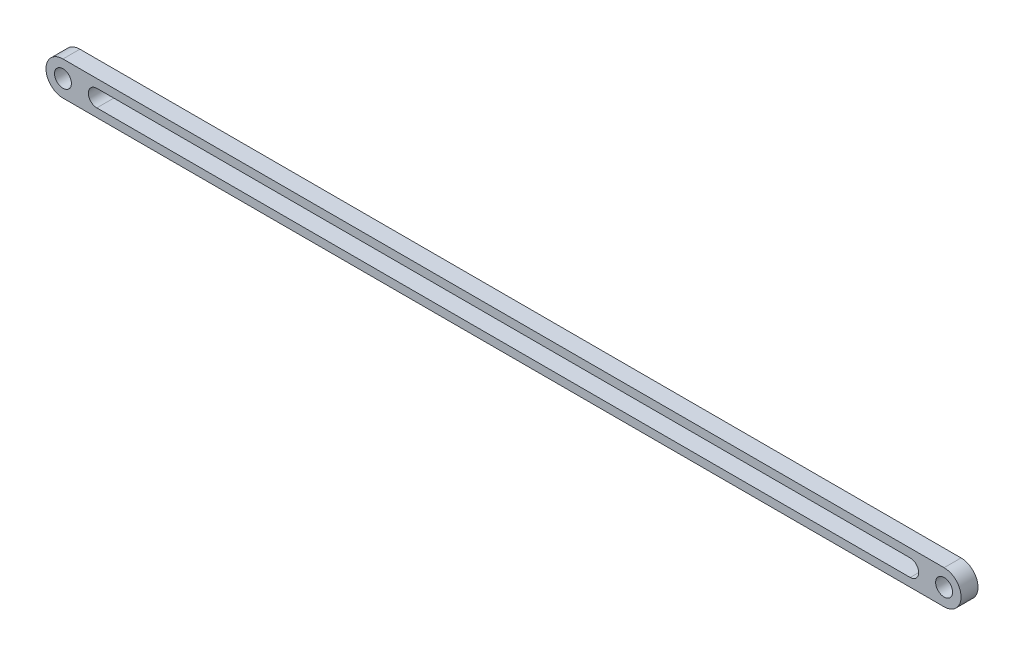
ISO-10303-21;
HEADER;
FILE_DESCRIPTION(('STEP AP214'),'2;1');
FILE_NAME('part.step','',(''),(''),'','','');
FILE_SCHEMA(('AUTOMOTIVE_DESIGN { 1 0 10303 214 1 1 1 1 }'));
ENDSEC;
DATA;
#1=APPLICATION_CONTEXT('core data for automotive mechanical design processes');
#2=APPLICATION_PROTOCOL_DEFINITION('international standard','automotive_design',2000,#1);
#3=PRODUCT_CONTEXT('',#1,'mechanical');
#4=PRODUCT('Part','Part','',(#3));
#5=PRODUCT_RELATED_PRODUCT_CATEGORY('part','',(#4));
#6=PRODUCT_DEFINITION_FORMATION('','',#4);
#7=PRODUCT_DEFINITION_CONTEXT('part definition',#1,'design');
#8=PRODUCT_DEFINITION('design','',#6,#7);
#9=PRODUCT_DEFINITION_SHAPE('','',#8);
#10=(LENGTH_UNIT() NAMED_UNIT(*) SI_UNIT(.MILLI.,.METRE.));
#11=(NAMED_UNIT(*) PLANE_ANGLE_UNIT() SI_UNIT($,.RADIAN.));
#12=(NAMED_UNIT(*) SI_UNIT($,.STERADIAN.) SOLID_ANGLE_UNIT());
#13=UNCERTAINTY_MEASURE_WITH_UNIT(LENGTH_MEASURE(1.E-05),#10,'distance_accuracy_value','');
#14=(GEOMETRIC_REPRESENTATION_CONTEXT(3) GLOBAL_UNCERTAINTY_ASSIGNED_CONTEXT((#13)) GLOBAL_UNIT_ASSIGNED_CONTEXT((#10,
#11,#12)) REPRESENTATION_CONTEXT('',''));
#15=CARTESIAN_POINT('',(0.,0.,0.));
#16=DIRECTION('',(0.,0.,1.));
#17=DIRECTION('',(1.,0.,0.));
#18=AXIS2_PLACEMENT_3D('',#15,#16,#17);
#19=CARTESIAN_POINT('',(0.,0.,3.175));
#20=DIRECTION('',(0.,0.,1.));
#21=DIRECTION('',(1.,0.,0.));
#22=AXIS2_PLACEMENT_3D('',#19,#20,#21);
#23=PLANE('',#22);
#24=CARTESIAN_POINT('',(0.,0.,3.175));
#25=DIRECTION('',(0.,0.,1.));
#26=DIRECTION('',(1.,0.,0.));
#27=AXIS2_PLACEMENT_3D('',#24,#25,#26);
#28=CIRCLE('',#27,1.5875);
#29=CARTESIAN_POINT('',(1.5875,0.,3.175));
#30=VERTEX_POINT('',#29);
#31=EDGE_CURVE('E161',#30,#30,#28,.T.);
#32=ORIENTED_EDGE('',*,*,#31,.F.);
#33=EDGE_LOOP('',(#32));
#34=FACE_BOUND('',#33,.T.);
#35=CARTESIAN_POINT('',(0.,0.,3.175));
#36=DIRECTION('',(0.,0.,1.));
#37=DIRECTION('',(1.,0.,0.));
#38=AXIS2_PLACEMENT_3D('',#35,#36,#37);
#39=CIRCLE('',#38,3.175);
#40=CARTESIAN_POINT('',(0.,3.175,3.175));
#41=VERTEX_POINT('',#40);
#42=CARTESIAN_POINT('',(0.,-3.175,3.175));
#43=VERTEX_POINT('',#42);
#44=EDGE_CURVE('E169',#41,#43,#39,.T.);
#45=ORIENTED_EDGE('',*,*,#44,.T.);
#46=DIRECTION('',(1.,0.,0.));
#47=VECTOR('',#46,1.);
#48=CARTESIAN_POINT('',(0.,-3.175,3.175));
#49=LINE('',#48,#47);
#50=CARTESIAN_POINT('',(165.1,-3.17499999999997,3.175));
#51=VERTEX_POINT('',#50);
#52=EDGE_CURVE('E173',#43,#51,#49,.T.);
#53=ORIENTED_EDGE('',*,*,#52,.T.);
#54=CARTESIAN_POINT('',(165.1,0.,3.175));
#55=DIRECTION('',(0.,0.,1.));
#56=DIRECTION('',(1.,0.,0.));
#57=AXIS2_PLACEMENT_3D('',#54,#55,#56);
#58=CIRCLE('',#57,3.175);
#59=CARTESIAN_POINT('',(165.1,3.17500000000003,3.175));
#60=VERTEX_POINT('',#59);
#61=EDGE_CURVE('E177',#51,#60,#58,.T.);
#62=ORIENTED_EDGE('',*,*,#61,.T.);
#63=DIRECTION('',(-1.,0.,0.));
#64=VECTOR('',#63,1.);
#65=CARTESIAN_POINT('',(0.,3.175,3.175));
#66=LINE('',#65,#64);
#67=EDGE_CURVE('E180',#60,#41,#66,.T.);
#68=ORIENTED_EDGE('',*,*,#67,.T.);
#69=EDGE_LOOP('',(#45,#53,#62,#68));
#70=FACE_BOUND('',#69,.T.);
#71=CARTESIAN_POINT('',(165.1,0.,3.175));
#72=DIRECTION('',(0.,0.,1.));
#73=DIRECTION('',(1.,0.,0.));
#74=AXIS2_PLACEMENT_3D('',#71,#72,#73);
#75=CIRCLE('',#74,1.58749999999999);
#76=CARTESIAN_POINT('',(166.6875,0.,3.175));
#77=VERTEX_POINT('',#76);
#78=EDGE_CURVE('E153',#77,#77,#75,.T.);
#79=ORIENTED_EDGE('',*,*,#78,.F.);
#80=EDGE_LOOP('',(#79));
#81=FACE_BOUND('',#80,.T.);
#82=DIRECTION('',(1.,0.,0.));
#83=VECTOR('',#82,1.);
#84=CARTESIAN_POINT('',(6.34999999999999,-1.5875,3.175));
#85=LINE('',#84,#83);
#86=CARTESIAN_POINT('',(6.34999999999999,-1.5875,3.175));
#87=VERTEX_POINT('',#86);
#88=CARTESIAN_POINT('',(158.75,-1.58749999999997,3.175));
#89=VERTEX_POINT('',#88);
#90=EDGE_CURVE('E114',#87,#89,#85,.T.);
#91=ORIENTED_EDGE('',*,*,#90,.F.);
#92=CARTESIAN_POINT('',(6.34999999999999,0.,3.175));
#93=DIRECTION('',(0.,0.,1.));
#94=DIRECTION('',(1.,0.,0.));
#95=AXIS2_PLACEMENT_3D('',#92,#93,#94);
#96=CIRCLE('',#95,1.5875);
#97=CARTESIAN_POINT('',(6.34999999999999,1.5875,3.175));
#98=VERTEX_POINT('',#97);
#99=EDGE_CURVE('E105',#98,#87,#96,.T.);
#100=ORIENTED_EDGE('',*,*,#99,.F.);
#101=DIRECTION('',(-1.,0.,0.));
#102=VECTOR('',#101,1.);
#103=CARTESIAN_POINT('',(6.34999999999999,1.5875,3.175));
#104=LINE('',#103,#102);
#105=CARTESIAN_POINT('',(158.75,1.58750000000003,3.175));
#106=VERTEX_POINT('',#105);
#107=EDGE_CURVE('E131',#106,#98,#104,.T.);
#108=ORIENTED_EDGE('',*,*,#107,.F.);
#109=CARTESIAN_POINT('',(158.75,0.,3.175));
#110=DIRECTION('',(0.,0.,1.));
#111=DIRECTION('',(1.,0.,0.));
#112=AXIS2_PLACEMENT_3D('',#109,#110,#111);
#113=CIRCLE('',#112,1.5875);
#114=EDGE_CURVE('E127',#89,#106,#113,.T.);
#115=ORIENTED_EDGE('',*,*,#114,.F.);
#116=EDGE_LOOP('',(#91,#100,#108,#115));
#117=FACE_BOUND('',#116,.T.);
#118=ADVANCED_FACE('F39',(#34,#70,#81,#117),#23,.T.);
#119=CARTESIAN_POINT('',(0.,0.,0.));
#120=DIRECTION('',(0.,0.,1.));
#121=DIRECTION('',(1.,0.,0.));
#122=AXIS2_PLACEMENT_3D('',#119,#120,#121);
#123=PLANE('',#122);
#124=CARTESIAN_POINT('',(165.1,0.,0.));
#125=DIRECTION('',(0.,0.,1.));
#126=DIRECTION('',(1.,0.,0.));
#127=AXIS2_PLACEMENT_3D('',#124,#125,#126);
#128=CIRCLE('',#127,1.58749999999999);
#129=CARTESIAN_POINT('',(166.6875,0.,0.));
#130=VERTEX_POINT('',#129);
#131=EDGE_CURVE('E123',#130,#130,#128,.T.);
#132=ORIENTED_EDGE('',*,*,#131,.T.);
#133=EDGE_LOOP('',(#132));
#134=FACE_BOUND('',#133,.T.);
#135=CARTESIAN_POINT('',(0.,0.,0.));
#136=DIRECTION('',(0.,0.,1.));
#137=DIRECTION('',(1.,0.,0.));
#138=AXIS2_PLACEMENT_3D('',#135,#136,#137);
#139=CIRCLE('',#138,1.5875);
#140=CARTESIAN_POINT('',(1.5875,0.,0.));
#141=VERTEX_POINT('',#140);
#142=EDGE_CURVE('E157',#141,#141,#139,.T.);
#143=ORIENTED_EDGE('',*,*,#142,.T.);
#144=EDGE_LOOP('',(#143));
#145=FACE_BOUND('',#144,.T.);
#146=CARTESIAN_POINT('',(0.,0.,0.));
#147=DIRECTION('',(0.,0.,1.));
#148=DIRECTION('',(1.,0.,0.));
#149=AXIS2_PLACEMENT_3D('',#146,#147,#148);
#150=CIRCLE('',#149,3.175);
#151=CARTESIAN_POINT('',(0.,3.175,0.));
#152=VERTEX_POINT('',#151);
#153=CARTESIAN_POINT('',(0.,-3.175,0.));
#154=VERTEX_POINT('',#153);
#155=EDGE_CURVE('E165',#152,#154,#150,.T.);
#156=ORIENTED_EDGE('',*,*,#155,.F.);
#157=DIRECTION('',(-1.,0.,0.));
#158=VECTOR('',#157,1.);
#159=CARTESIAN_POINT('',(0.,3.175,0.));
#160=LINE('',#159,#158);
#161=CARTESIAN_POINT('',(165.1,3.17500000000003,0.));
#162=VERTEX_POINT('',#161);
#163=EDGE_CURVE('E174',#162,#152,#160,.T.);
#164=ORIENTED_EDGE('',*,*,#163,.F.);
#165=CARTESIAN_POINT('',(165.1,0.,0.));
#166=DIRECTION('',(0.,0.,1.));
#167=DIRECTION('',(1.,0.,0.));
#168=AXIS2_PLACEMENT_3D('',#165,#166,#167);
#169=CIRCLE('',#168,3.175);
#170=CARTESIAN_POINT('',(165.1,-3.17499999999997,0.));
#171=VERTEX_POINT('',#170);
#172=EDGE_CURVE('E190',#171,#162,#169,.T.);
#173=ORIENTED_EDGE('',*,*,#172,.F.);
#174=DIRECTION('',(1.,0.,0.));
#175=VECTOR('',#174,1.);
#176=CARTESIAN_POINT('',(0.,-3.175,0.));
#177=LINE('',#176,#175);
#178=EDGE_CURVE('E187',#154,#171,#177,.T.);
#179=ORIENTED_EDGE('',*,*,#178,.F.);
#180=EDGE_LOOP('',(#156,#164,#173,#179));
#181=FACE_BOUND('',#180,.T.);
#182=CARTESIAN_POINT('',(6.34999999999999,0.,0.));
#183=DIRECTION('',(0.,0.,1.));
#184=DIRECTION('',(1.,0.,0.));
#185=AXIS2_PLACEMENT_3D('',#182,#183,#184);
#186=CIRCLE('',#185,1.5875);
#187=CARTESIAN_POINT('',(6.34999999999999,1.5875,0.));
#188=VERTEX_POINT('',#187);
#189=CARTESIAN_POINT('',(6.34999999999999,-1.5875,0.));
#190=VERTEX_POINT('',#189);
#191=EDGE_CURVE('E63',#188,#190,#186,.T.);
#192=ORIENTED_EDGE('',*,*,#191,.T.);
#193=DIRECTION('',(1.,0.,0.));
#194=VECTOR('',#193,1.);
#195=CARTESIAN_POINT('',(6.34999999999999,-1.5875,0.));
#196=LINE('',#195,#194);
#197=CARTESIAN_POINT('',(158.75,-1.58749999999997,0.));
#198=VERTEX_POINT('',#197);
#199=EDGE_CURVE('E121',#190,#198,#196,.T.);
#200=ORIENTED_EDGE('',*,*,#199,.T.);
#201=CARTESIAN_POINT('',(158.75,0.,0.));
#202=DIRECTION('',(0.,0.,1.));
#203=DIRECTION('',(1.,0.,0.));
#204=AXIS2_PLACEMENT_3D('',#201,#202,#203);
#205=CIRCLE('',#204,1.5875);
#206=CARTESIAN_POINT('',(158.75,1.58750000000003,0.));
#207=VERTEX_POINT('',#206);
#208=EDGE_CURVE('E140',#198,#207,#205,.T.);
#209=ORIENTED_EDGE('',*,*,#208,.T.);
#210=DIRECTION('',(-1.,0.,0.));
#211=VECTOR('',#210,1.);
#212=CARTESIAN_POINT('',(6.34999999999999,1.5875,0.));
#213=LINE('',#212,#211);
#214=EDGE_CURVE('E115',#207,#188,#213,.T.);
#215=ORIENTED_EDGE('',*,*,#214,.T.);
#216=EDGE_LOOP('',(#192,#200,#209,#215));
#217=FACE_BOUND('',#216,.T.);
#218=ADVANCED_FACE('F213',(#134,#145,#181,#217),#123,.F.);
#219=CARTESIAN_POINT('',(0.,0.,3.175));
#220=DIRECTION('',(0.,0.,-1.));
#221=DIRECTION('',(-1.,0.,0.));
#222=AXIS2_PLACEMENT_3D('',#219,#220,#221);
#223=CYLINDRICAL_SURFACE('',#222,3.175);
#224=ORIENTED_EDGE('',*,*,#155,.T.);
#225=DIRECTION('',(0.,0.,-1.));
#226=VECTOR('',#225,1.);
#227=CARTESIAN_POINT('',(0.,-3.175,3.175));
#228=LINE('',#227,#226);
#229=EDGE_CURVE('E11',#43,#154,#228,.T.);
#230=ORIENTED_EDGE('',*,*,#229,.F.);
#231=ORIENTED_EDGE('',*,*,#44,.F.);
#232=DIRECTION('',(0.,0.,-1.));
#233=VECTOR('',#232,1.);
#234=CARTESIAN_POINT('',(0.,3.175,3.175));
#235=LINE('',#234,#233);
#236=EDGE_CURVE('E183',#41,#152,#235,.T.);
#237=ORIENTED_EDGE('',*,*,#236,.T.);
#238=EDGE_LOOP('',(#224,#230,#231,#237));
#239=FACE_BOUND('',#238,.T.);
#240=ADVANCED_FACE('F41',(#239),#223,.T.);
#241=CARTESIAN_POINT('',(0.,-3.175,3.175));
#242=DIRECTION('',(0.,1.,0.));
#243=DIRECTION('',(-1.,0.,0.));
#244=AXIS2_PLACEMENT_3D('',#241,#242,#243);
#245=PLANE('',#244);
#246=ORIENTED_EDGE('',*,*,#178,.T.);
#247=DIRECTION('',(0.,0.,-1.));
#248=VECTOR('',#247,1.);
#249=CARTESIAN_POINT('',(165.1,-3.17499999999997,3.175));
#250=LINE('',#249,#248);
#251=EDGE_CURVE('E48',#51,#171,#250,.T.);
#252=ORIENTED_EDGE('',*,*,#251,.F.);
#253=ORIENTED_EDGE('',*,*,#52,.F.);
#254=ORIENTED_EDGE('',*,*,#229,.T.);
#255=EDGE_LOOP('',(#246,#252,#253,#254));
#256=FACE_BOUND('',#255,.T.);
#257=ADVANCED_FACE('F224',(#256),#245,.F.);
#258=CARTESIAN_POINT('',(165.1,0.,3.175));
#259=DIRECTION('',(0.,0.,-1.));
#260=DIRECTION('',(-1.,0.,0.));
#261=AXIS2_PLACEMENT_3D('',#258,#259,#260);
#262=CYLINDRICAL_SURFACE('',#261,3.175);
#263=ORIENTED_EDGE('',*,*,#172,.T.);
#264=DIRECTION('',(0.,0.,-1.));
#265=VECTOR('',#264,1.);
#266=CARTESIAN_POINT('',(165.1,3.17500000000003,3.175));
#267=LINE('',#266,#265);
#268=EDGE_CURVE('E198',#60,#162,#267,.T.);
#269=ORIENTED_EDGE('',*,*,#268,.F.);
#270=ORIENTED_EDGE('',*,*,#61,.F.);
#271=ORIENTED_EDGE('',*,*,#251,.T.);
#272=EDGE_LOOP('',(#263,#269,#270,#271));
#273=FACE_BOUND('',#272,.T.);
#274=ADVANCED_FACE('F207',(#273),#262,.T.);
#275=CARTESIAN_POINT('',(0.,3.175,3.175));
#276=DIRECTION('',(0.,-1.,0.));
#277=DIRECTION('',(1.,0.,0.));
#278=AXIS2_PLACEMENT_3D('',#275,#276,#277);
#279=PLANE('',#278);
#280=ORIENTED_EDGE('',*,*,#163,.T.);
#281=ORIENTED_EDGE('',*,*,#236,.F.);
#282=ORIENTED_EDGE('',*,*,#67,.F.);
#283=ORIENTED_EDGE('',*,*,#268,.T.);
#284=EDGE_LOOP('',(#280,#281,#282,#283));
#285=FACE_BOUND('',#284,.T.);
#286=ADVANCED_FACE('F217',(#285),#279,.F.);
#287=CARTESIAN_POINT('',(0.,0.,3.175));
#288=DIRECTION('',(0.,0.,-1.));
#289=DIRECTION('',(-1.,0.,0.));
#290=AXIS2_PLACEMENT_3D('',#287,#288,#289);
#291=CYLINDRICAL_SURFACE('',#290,1.5875);
#292=ORIENTED_EDGE('',*,*,#31,.T.);
#293=EDGE_LOOP('',(#292));
#294=FACE_BOUND('',#293,.T.);
#295=ORIENTED_EDGE('',*,*,#142,.F.);
#296=EDGE_LOOP('',(#295));
#297=FACE_BOUND('',#296,.T.);
#298=ADVANCED_FACE('F241',(#294,#297),#291,.F.);
#299=CARTESIAN_POINT('',(165.1,0.,3.175));
#300=DIRECTION('',(0.,0.,-1.));
#301=DIRECTION('',(-1.,0.,0.));
#302=AXIS2_PLACEMENT_3D('',#299,#300,#301);
#303=CYLINDRICAL_SURFACE('',#302,1.58749999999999);
#304=ORIENTED_EDGE('',*,*,#78,.T.);
#305=EDGE_LOOP('',(#304));
#306=FACE_BOUND('',#305,.T.);
#307=ORIENTED_EDGE('',*,*,#131,.F.);
#308=EDGE_LOOP('',(#307));
#309=FACE_BOUND('',#308,.T.);
#310=ADVANCED_FACE('F248',(#306,#309),#303,.F.);
#311=CARTESIAN_POINT('',(6.34999999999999,0.,3.175));
#312=DIRECTION('',(0.,0.,-1.));
#313=DIRECTION('',(-1.,0.,0.));
#314=AXIS2_PLACEMENT_3D('',#311,#312,#313);
#315=CYLINDRICAL_SURFACE('',#314,1.5875);
#316=ORIENTED_EDGE('',*,*,#191,.F.);
#317=DIRECTION('',(0.,0.,-1.));
#318=VECTOR('',#317,1.);
#319=CARTESIAN_POINT('',(6.34999999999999,1.5875,3.175));
#320=LINE('',#319,#318);
#321=EDGE_CURVE('E109',#98,#188,#320,.T.);
#322=ORIENTED_EDGE('',*,*,#321,.F.);
#323=ORIENTED_EDGE('',*,*,#99,.T.);
#324=DIRECTION('',(0.,0.,-1.));
#325=VECTOR('',#324,1.);
#326=CARTESIAN_POINT('',(6.34999999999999,-1.5875,3.175));
#327=LINE('',#326,#325);
#328=EDGE_CURVE('E108',#87,#190,#327,.T.);
#329=ORIENTED_EDGE('',*,*,#328,.T.);
#330=EDGE_LOOP('',(#316,#322,#323,#329));
#331=FACE_BOUND('',#330,.T.);
#332=ADVANCED_FACE('F107',(#331),#315,.F.);
#333=CARTESIAN_POINT('',(6.34999999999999,-1.5875,3.175));
#334=DIRECTION('',(0.,1.,0.));
#335=DIRECTION('',(-1.,0.,0.));
#336=AXIS2_PLACEMENT_3D('',#333,#334,#335);
#337=PLANE('',#336);
#338=ORIENTED_EDGE('',*,*,#199,.F.);
#339=ORIENTED_EDGE('',*,*,#328,.F.);
#340=ORIENTED_EDGE('',*,*,#90,.T.);
#341=DIRECTION('',(0.,0.,-1.));
#342=VECTOR('',#341,1.);
#343=CARTESIAN_POINT('',(158.75,-1.58749999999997,3.175));
#344=LINE('',#343,#342);
#345=EDGE_CURVE('E124',#89,#198,#344,.T.);
#346=ORIENTED_EDGE('',*,*,#345,.T.);
#347=EDGE_LOOP('',(#338,#339,#340,#346));
#348=FACE_BOUND('',#347,.T.);
#349=ADVANCED_FACE('F118',(#348),#337,.T.);
#350=CARTESIAN_POINT('',(158.75,0.,3.175));
#351=DIRECTION('',(0.,0.,-1.));
#352=DIRECTION('',(-1.,0.,0.));
#353=AXIS2_PLACEMENT_3D('',#350,#351,#352);
#354=CYLINDRICAL_SURFACE('',#353,1.5875);
#355=ORIENTED_EDGE('',*,*,#208,.F.);
#356=ORIENTED_EDGE('',*,*,#345,.F.);
#357=ORIENTED_EDGE('',*,*,#114,.T.);
#358=DIRECTION('',(0.,0.,-1.));
#359=VECTOR('',#358,1.);
#360=CARTESIAN_POINT('',(158.75,1.58750000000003,3.175));
#361=LINE('',#360,#359);
#362=EDGE_CURVE('E55',#106,#207,#361,.T.);
#363=ORIENTED_EDGE('',*,*,#362,.T.);
#364=EDGE_LOOP('',(#355,#356,#357,#363));
#365=FACE_BOUND('',#364,.T.);
#366=ADVANCED_FACE('F265',(#365),#354,.F.);
#367=CARTESIAN_POINT('',(6.34999999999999,1.5875,3.175));
#368=DIRECTION('',(0.,-1.,0.));
#369=DIRECTION('',(1.,0.,0.));
#370=AXIS2_PLACEMENT_3D('',#367,#368,#369);
#371=PLANE('',#370);
#372=ORIENTED_EDGE('',*,*,#214,.F.);
#373=ORIENTED_EDGE('',*,*,#362,.F.);
#374=ORIENTED_EDGE('',*,*,#107,.T.);
#375=ORIENTED_EDGE('',*,*,#321,.T.);
#376=EDGE_LOOP('',(#372,#373,#374,#375));
#377=FACE_BOUND('',#376,.T.);
#378=ADVANCED_FACE('F268',(#377),#371,.T.);
#379=CLOSED_SHELL('',(#118,#218,#240,#257,#274,#286,#298,#310,#332,#349,#366,#378));
#380=MANIFOLD_SOLID_BREP('B2',#379);
#381=ADVANCED_BREP_SHAPE_REPRESENTATION('',(#18,#380),#14);
#382=SHAPE_DEFINITION_REPRESENTATION(#9,#381);
ENDSEC;
END-ISO-10303-21;
